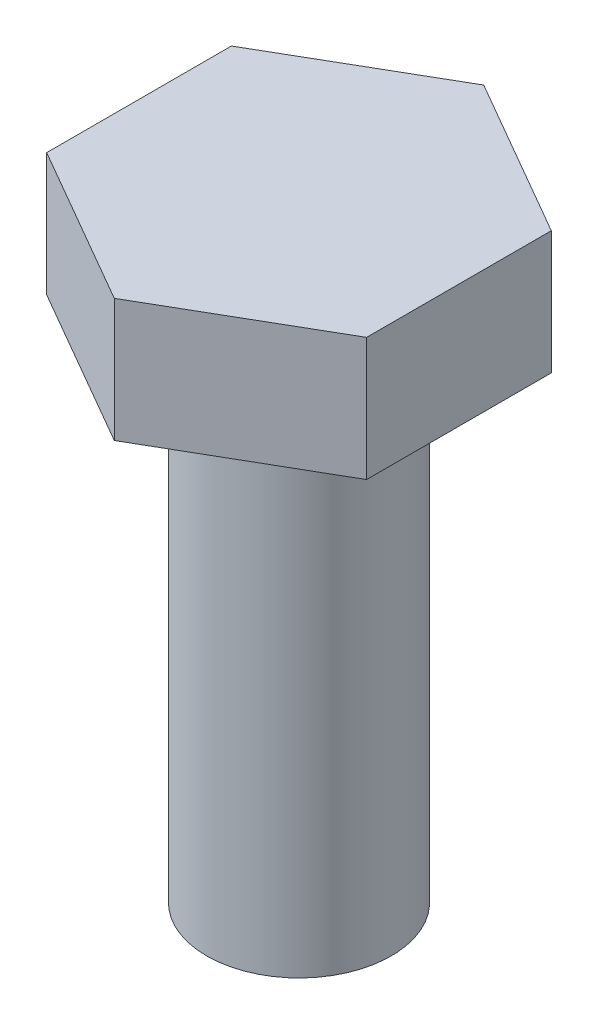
from build123d import *

# Parameters (mm, degrees)
SKETCH1_R      = 7.5
EXTRUDE1_DEPTH = 40
EXTRUDE2_DEPTH = 10


with BuildPart() as part:
    # Sketch1 → Extrude1 (new body)
    with BuildSketch(Plane(origin=(0, 0, 0), x_dir=(1, 0, 0), z_dir=(0, 1, 0))):
        with Locations(Location((0, 0, 0), (0, 0, 270))):
            Circle(SKETCH1_R)
    extrude(amount=EXTRUDE1_DEPTH)

    # Sketch2 → Extrude2 (add)
    with BuildSketch(Plane(origin=(0, 40, 0), x_dir=(1, 0, 0), z_dir=(0, 1, 0))):
        Polygon((12.990381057, 7.5), (0, 15), (-12.990381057, 7.5), (-12.990381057, -7.5), (0, -15), (12.990381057, -7.5), align=None)
    extrude(amount=EXTRUDE2_DEPTH)


solid = part.part
